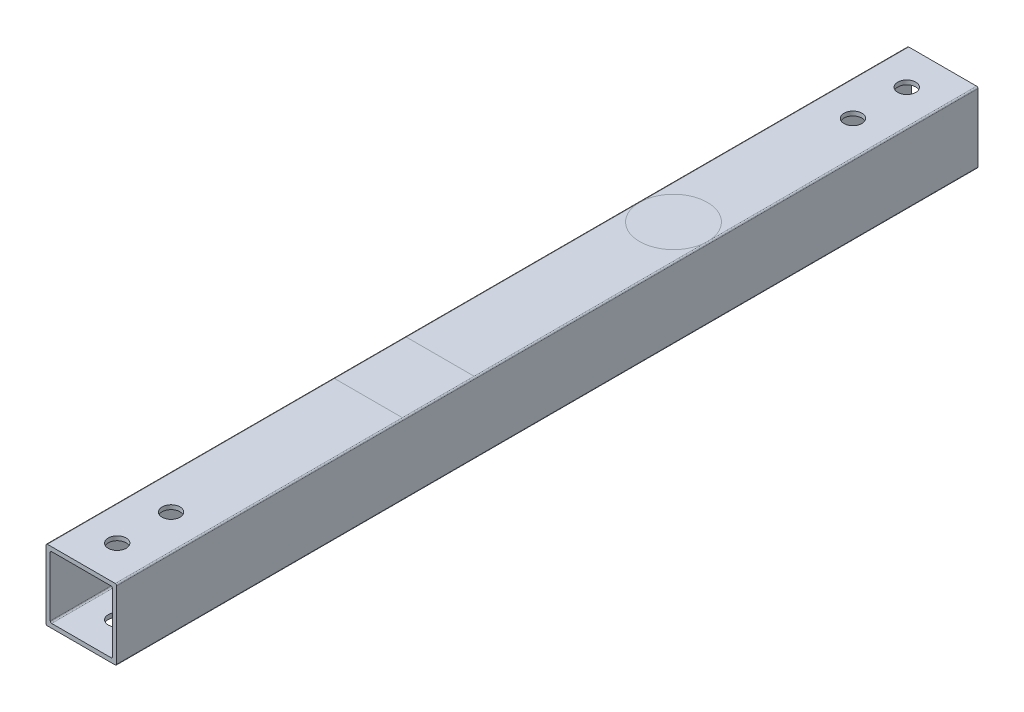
ISO-10303-21;
HEADER;
FILE_DESCRIPTION(('STEP AP214'),'2;1');
FILE_NAME('part.step','',(''),(''),'','','');
FILE_SCHEMA(('AUTOMOTIVE_DESIGN { 1 0 10303 214 1 1 1 1 }'));
ENDSEC;
DATA;
#1=APPLICATION_CONTEXT('core data for automotive mechanical design processes');
#2=APPLICATION_PROTOCOL_DEFINITION('international standard','automotive_design',2000,#1);
#3=PRODUCT_CONTEXT('',#1,'mechanical');
#4=PRODUCT('Part','Part','',(#3));
#5=PRODUCT_RELATED_PRODUCT_CATEGORY('part','',(#4));
#6=PRODUCT_DEFINITION_FORMATION('','',#4);
#7=PRODUCT_DEFINITION_CONTEXT('part definition',#1,'design');
#8=PRODUCT_DEFINITION('design','',#6,#7);
#9=PRODUCT_DEFINITION_SHAPE('','',#8);
#10=(LENGTH_UNIT() NAMED_UNIT(*) SI_UNIT(.MILLI.,.METRE.));
#11=(NAMED_UNIT(*) PLANE_ANGLE_UNIT() SI_UNIT($,.RADIAN.));
#12=(NAMED_UNIT(*) SI_UNIT($,.STERADIAN.) SOLID_ANGLE_UNIT());
#13=UNCERTAINTY_MEASURE_WITH_UNIT(LENGTH_MEASURE(1.E-05),#10,'distance_accuracy_value','');
#14=(GEOMETRIC_REPRESENTATION_CONTEXT(3) GLOBAL_UNCERTAINTY_ASSIGNED_CONTEXT((#13)) GLOBAL_UNIT_ASSIGNED_CONTEXT((#10,
#11,#12)) REPRESENTATION_CONTEXT('',''));
#15=CARTESIAN_POINT('',(0.,0.,0.));
#16=DIRECTION('',(0.,0.,1.));
#17=DIRECTION('',(1.,0.,0.));
#18=AXIS2_PLACEMENT_3D('',#15,#16,#17);
#19=CARTESIAN_POINT('',(-11.9999999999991,12.5,-1695.2));
#20=DIRECTION('',(0.,1.,0.));
#21=DIRECTION('',(-1.,0.,0.));
#22=AXIS2_PLACEMENT_3D('',#19,#20,#21);
#23=PLANE('',#22);
#24=CARTESIAN_POINT('',(0.,12.5,-1968.25));
#25=DIRECTION('',(0.,1.,0.));
#26=DIRECTION('',(-1.,0.,0.));
#27=AXIS2_PLACEMENT_3D('',#24,#25,#26);
#28=CIRCLE('',#27,3.17500000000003);
#29=CARTESIAN_POINT('',(-3.17500000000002,12.5,-1968.25));
#30=VERTEX_POINT('',#29);
#31=EDGE_CURVE('E436',#30,#30,#28,.T.);
#32=ORIENTED_EDGE('',*,*,#31,.F.);
#33=EDGE_LOOP('',(#32));
#34=FACE_BOUND('',#33,.T.);
#35=CARTESIAN_POINT('',(0.,12.5,-1987.3));
#36=DIRECTION('',(0.,1.,0.));
#37=DIRECTION('',(-1.,0.,0.));
#38=AXIS2_PLACEMENT_3D('',#35,#36,#37);
#39=CIRCLE('',#38,3.17500000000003);
#40=CARTESIAN_POINT('',(-3.17500000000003,12.5,-1987.3));
#41=VERTEX_POINT('',#40);
#42=EDGE_CURVE('E559',#41,#41,#39,.T.);
#43=ORIENTED_EDGE('',*,*,#42,.F.);
#44=EDGE_LOOP('',(#43));
#45=FACE_BOUND('',#44,.T.);
#46=DIRECTION('',(0.,0.,-1.));
#47=VECTOR('',#46,1.);
#48=CARTESIAN_POINT('',(-11.9999999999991,12.5,-1695.2));
#49=LINE('',#48,#47);
#50=CARTESIAN_POINT('',(-11.9999999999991,12.5,-1904.75));
#51=VERTEX_POINT('',#50);
#52=CARTESIAN_POINT('',(-11.9999999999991,12.5,-2000.));
#53=VERTEX_POINT('',#52);
#54=EDGE_CURVE('E318',#51,#53,#49,.T.);
#55=ORIENTED_EDGE('',*,*,#54,.F.);
#56=CARTESIAN_POINT('',(0.,12.5,-1904.75));
#57=DIRECTION('',(0.,1.,0.));
#58=DIRECTION('',(-1.,0.,0.));
#59=AXIS2_PLACEMENT_3D('',#56,#57,#58);
#60=CIRCLE('',#59,11.9999999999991);
#61=CARTESIAN_POINT('',(11.9999999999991,12.5,-1904.75));
#62=VERTEX_POINT('',#61);
#63=EDGE_CURVE('E11',#51,#62,#60,.F.);
#64=ORIENTED_EDGE('',*,*,#63,.T.);
#65=DIRECTION('',(0.,0.,-1.));
#66=VECTOR('',#65,1.);
#67=CARTESIAN_POINT('',(11.9999999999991,12.5,-1695.2));
#68=LINE('',#67,#66);
#69=CARTESIAN_POINT('',(11.9999999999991,12.5,-2000.));
#70=VERTEX_POINT('',#69);
#71=EDGE_CURVE('E313',#62,#70,#68,.T.);
#72=ORIENTED_EDGE('',*,*,#71,.T.);
#73=DIRECTION('',(1.,0.,0.));
#74=VECTOR('',#73,1.);
#75=CARTESIAN_POINT('',(-11.9999999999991,12.5,-2000.));
#76=LINE('',#75,#74);
#77=EDGE_CURVE('E286',#53,#70,#76,.T.);
#78=ORIENTED_EDGE('',*,*,#77,.F.);
#79=EDGE_LOOP('',(#55,#64,#72,#78));
#80=FACE_BOUND('',#79,.T.);
#81=ADVANCED_FACE('F45',(#34,#45,#80),#23,.T.);
#82=CARTESIAN_POINT('',(11.9999999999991,12.5,-1822.2));
#83=VERTEX_POINT('',#82);
#84=EDGE_CURVE('E356',#83,#62,#68,.T.);
#85=ORIENTED_EDGE('',*,*,#84,.T.);
#86=EDGE_CURVE('E49',#62,#51,#60,.F.);
#87=ORIENTED_EDGE('',*,*,#86,.T.);
#88=CARTESIAN_POINT('',(-11.9999999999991,12.5,-1822.2));
#89=VERTEX_POINT('',#88);
#90=EDGE_CURVE('E353',#89,#51,#49,.T.);
#91=ORIENTED_EDGE('',*,*,#90,.F.);
#92=DIRECTION('',(1.,0.,0.));
#93=VECTOR('',#92,1.);
#94=CARTESIAN_POINT('',(-11.9999999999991,12.5,-1822.2));
#95=LINE('',#94,#93);
#96=EDGE_CURVE('E302',#89,#83,#95,.T.);
#97=ORIENTED_EDGE('',*,*,#96,.T.);
#98=EDGE_LOOP('',(#85,#87,#91,#97));
#99=FACE_BOUND('',#98,.T.);
#100=ADVANCED_FACE('F351',(#99),#23,.T.);
#101=CARTESIAN_POINT('',(0.,12.5,-1726.95));
#102=DIRECTION('',(0.,1.,0.));
#103=DIRECTION('',(1.,0.,0.));
#104=AXIS2_PLACEMENT_3D('',#101,#102,#103);
#105=CIRCLE('',#104,3.17500000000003);
#106=CARTESIAN_POINT('',(3.17500000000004,12.5,-1726.95));
#107=VERTEX_POINT('',#106);
#108=EDGE_CURVE('E427',#107,#107,#105,.T.);
#109=ORIENTED_EDGE('',*,*,#108,.F.);
#110=EDGE_LOOP('',(#109));
#111=FACE_BOUND('',#110,.T.);
#112=CARTESIAN_POINT('',(0.,12.5,-1707.9));
#113=DIRECTION('',(0.,1.,0.));
#114=DIRECTION('',(1.,0.,0.));
#115=AXIS2_PLACEMENT_3D('',#112,#113,#114);
#116=CIRCLE('',#115,3.17500000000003);
#117=CARTESIAN_POINT('',(3.17500000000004,12.5,-1707.9));
#118=VERTEX_POINT('',#117);
#119=EDGE_CURVE('E430',#118,#118,#116,.T.);
#120=ORIENTED_EDGE('',*,*,#119,.F.);
#121=EDGE_LOOP('',(#120));
#122=FACE_BOUND('',#121,.T.);
#123=CARTESIAN_POINT('',(11.9999999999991,12.5,-1695.2));
#124=VERTEX_POINT('',#123);
#125=CARTESIAN_POINT('',(11.9999999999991,12.5,-1796.8));
#126=VERTEX_POINT('',#125);
#127=EDGE_CURVE('E309',#124,#126,#68,.T.);
#128=ORIENTED_EDGE('',*,*,#127,.T.);
#129=DIRECTION('',(-1.,0.,0.));
#130=VECTOR('',#129,1.);
#131=CARTESIAN_POINT('',(-11.9999999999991,12.5,-1796.8));
#132=LINE('',#131,#130);
#133=CARTESIAN_POINT('',(-11.9999999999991,12.5,-1796.8));
#134=VERTEX_POINT('',#133);
#135=EDGE_CURVE('E339',#126,#134,#132,.T.);
#136=ORIENTED_EDGE('',*,*,#135,.T.);
#137=CARTESIAN_POINT('',(-11.9999999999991,12.5,-1695.2));
#138=VERTEX_POINT('',#137);
#139=EDGE_CURVE('E314',#138,#134,#49,.T.);
#140=ORIENTED_EDGE('',*,*,#139,.F.);
#141=DIRECTION('',(1.,0.,0.));
#142=VECTOR('',#141,1.);
#143=CARTESIAN_POINT('',(-11.9999999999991,12.5,-1695.2));
#144=LINE('',#143,#142);
#145=EDGE_CURVE('E262',#138,#124,#144,.T.);
#146=ORIENTED_EDGE('',*,*,#145,.T.);
#147=EDGE_LOOP('',(#128,#136,#140,#146));
#148=FACE_BOUND('',#147,.T.);
#149=ADVANCED_FACE('F407',(#111,#122,#148),#23,.T.);
#150=ORIENTED_EDGE('',*,*,#63,.F.);
#151=ORIENTED_EDGE('',*,*,#86,.F.);
#152=EDGE_LOOP('',(#150,#151));
#153=FACE_BOUND('',#152,.T.);
#154=ADVANCED_FACE('F412',(#153),#23,.T.);
#155=CARTESIAN_POINT('',(-11.9999999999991,-11.9999999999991,-1695.2));
#156=DIRECTION('',(0.,0.,-1.));
#157=DIRECTION('',(-1.,0.,0.));
#158=AXIS2_PLACEMENT_3D('',#155,#156,#157);
#159=CYLINDRICAL_SURFACE('',#158,0.500000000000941);
#160=CARTESIAN_POINT('',(-11.9999999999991,-11.9999999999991,-2000.));
#161=DIRECTION('',(0.,0.,-1.));
#162=DIRECTION('',(-1.,0.,0.));
#163=AXIS2_PLACEMENT_3D('',#160,#161,#162);
#164=CIRCLE('',#163,0.500000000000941);
#165=CARTESIAN_POINT('',(-11.9999999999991,-12.5,-2000.));
#166=VERTEX_POINT('',#165);
#167=CARTESIAN_POINT('',(-12.5,-11.9999999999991,-2000.));
#168=VERTEX_POINT('',#167);
#169=EDGE_CURVE('E240',#166,#168,#164,.T.);
#170=ORIENTED_EDGE('',*,*,#169,.F.);
#171=DIRECTION('',(0.,0.,-1.));
#172=VECTOR('',#171,1.);
#173=CARTESIAN_POINT('',(-11.9999999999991,-12.5,-1695.2));
#174=LINE('',#173,#172);
#175=CARTESIAN_POINT('',(-11.9999999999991,-12.5,-1695.2));
#176=VERTEX_POINT('',#175);
#177=EDGE_CURVE('E300',#176,#166,#174,.T.);
#178=ORIENTED_EDGE('',*,*,#177,.F.);
#179=CARTESIAN_POINT('',(-11.9999999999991,-11.9999999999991,-1695.2));
#180=DIRECTION('',(0.,0.,-1.));
#181=DIRECTION('',(-1.,0.,0.));
#182=AXIS2_PLACEMENT_3D('',#179,#180,#181);
#183=CIRCLE('',#182,0.500000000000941);
#184=CARTESIAN_POINT('',(-12.5,-11.9999999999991,-1695.2));
#185=VERTEX_POINT('',#184);
#186=EDGE_CURVE('E252',#176,#185,#183,.T.);
#187=ORIENTED_EDGE('',*,*,#186,.T.);
#188=DIRECTION('',(0.,0.,-1.));
#189=VECTOR('',#188,1.);
#190=CARTESIAN_POINT('',(-12.5,-11.9999999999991,-1695.2));
#191=LINE('',#190,#189);
#192=EDGE_CURVE('E277',#185,#168,#191,.T.);
#193=ORIENTED_EDGE('',*,*,#192,.T.);
#194=EDGE_LOOP('',(#170,#178,#187,#193));
#195=FACE_BOUND('',#194,.T.);
#196=ADVANCED_FACE('F47',(#195),#159,.T.);
#197=CARTESIAN_POINT('',(11.9999999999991,-12.5,-1695.2));
#198=DIRECTION('',(0.,-1.,0.));
#199=DIRECTION('',(1.,0.,0.));
#200=AXIS2_PLACEMENT_3D('',#197,#198,#199);
#201=PLANE('',#200);
#202=CARTESIAN_POINT('',(0.,-12.5,-1987.3));
#203=DIRECTION('',(0.,-1.,0.));
#204=DIRECTION('',(1.,0.,0.));
#205=AXIS2_PLACEMENT_3D('',#202,#203,#204);
#206=CIRCLE('',#205,3.17500000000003);
#207=CARTESIAN_POINT('',(3.17500000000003,-12.5,-1987.3));
#208=VERTEX_POINT('',#207);
#209=EDGE_CURVE('E326',#208,#208,#206,.F.);
#210=ORIENTED_EDGE('',*,*,#209,.T.);
#211=EDGE_LOOP('',(#210));
#212=FACE_BOUND('',#211,.T.);
#213=CARTESIAN_POINT('',(0.,-12.5,-1726.95));
#214=DIRECTION('',(0.,-1.,0.));
#215=DIRECTION('',(1.,0.,0.));
#216=AXIS2_PLACEMENT_3D('',#213,#214,#215);
#217=CIRCLE('',#216,3.17500000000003);
#218=CARTESIAN_POINT('',(3.17500000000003,-12.5,-1726.95));
#219=VERTEX_POINT('',#218);
#220=EDGE_CURVE('E550',#219,#219,#217,.F.);
#221=ORIENTED_EDGE('',*,*,#220,.T.);
#222=EDGE_LOOP('',(#221));
#223=FACE_BOUND('',#222,.T.);
#224=CARTESIAN_POINT('',(0.,-12.5,-1707.9));
#225=DIRECTION('',(0.,-1.,0.));
#226=DIRECTION('',(1.,0.,0.));
#227=AXIS2_PLACEMENT_3D('',#224,#225,#226);
#228=CIRCLE('',#227,3.17500000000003);
#229=CARTESIAN_POINT('',(3.17500000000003,-12.5,-1707.9));
#230=VERTEX_POINT('',#229);
#231=EDGE_CURVE('E433',#230,#230,#228,.F.);
#232=ORIENTED_EDGE('',*,*,#231,.T.);
#233=EDGE_LOOP('',(#232));
#234=FACE_BOUND('',#233,.T.);
#235=CARTESIAN_POINT('',(0.,-12.5,-1968.25));
#236=DIRECTION('',(0.,-1.,0.));
#237=DIRECTION('',(1.,0.,0.));
#238=AXIS2_PLACEMENT_3D('',#235,#236,#237);
#239=CIRCLE('',#238,3.17500000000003);
#240=CARTESIAN_POINT('',(3.17500000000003,-12.5,-1968.25));
#241=VERTEX_POINT('',#240);
#242=EDGE_CURVE('E432',#241,#241,#239,.F.);
#243=ORIENTED_EDGE('',*,*,#242,.T.);
#244=EDGE_LOOP('',(#243));
#245=FACE_BOUND('',#244,.T.);
#246=DIRECTION('',(-1.,0.,0.));
#247=VECTOR('',#246,1.);
#248=CARTESIAN_POINT('',(11.9999999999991,-12.5,-2000.));
#249=LINE('',#248,#247);
#250=CARTESIAN_POINT('',(11.9999999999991,-12.5,-2000.));
#251=VERTEX_POINT('',#250);
#252=EDGE_CURVE('E256',#251,#166,#249,.T.);
#253=ORIENTED_EDGE('',*,*,#252,.F.);
#254=DIRECTION('',(0.,0.,-1.));
#255=VECTOR('',#254,1.);
#256=CARTESIAN_POINT('',(11.9999999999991,-12.5,-1695.2));
#257=LINE('',#256,#255);
#258=CARTESIAN_POINT('',(11.9999999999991,-12.5,-1695.2));
#259=VERTEX_POINT('',#258);
#260=EDGE_CURVE('E303',#259,#251,#257,.T.);
#261=ORIENTED_EDGE('',*,*,#260,.F.);
#262=DIRECTION('',(-1.,0.,0.));
#263=VECTOR('',#262,1.);
#264=CARTESIAN_POINT('',(11.9999999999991,-12.5,-1695.2));
#265=LINE('',#264,#263);
#266=EDGE_CURVE('E274',#259,#176,#265,.T.);
#267=ORIENTED_EDGE('',*,*,#266,.T.);
#268=ORIENTED_EDGE('',*,*,#177,.T.);
#269=EDGE_LOOP('',(#253,#261,#267,#268));
#270=FACE_BOUND('',#269,.T.);
#271=ADVANCED_FACE('F386',(#212,#223,#234,#245,#270),#201,.T.);
#272=CARTESIAN_POINT('',(11.9999999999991,-11.9999999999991,-1695.2));
#273=DIRECTION('',(0.,0.,-1.));
#274=DIRECTION('',(-1.,0.,0.));
#275=AXIS2_PLACEMENT_3D('',#272,#273,#274);
#276=CYLINDRICAL_SURFACE('',#275,0.500000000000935);
#277=CARTESIAN_POINT('',(11.9999999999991,-11.9999999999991,-2000.));
#278=DIRECTION('',(0.,0.,-1.));
#279=DIRECTION('',(-1.,0.,0.));
#280=AXIS2_PLACEMENT_3D('',#277,#278,#279);
#281=CIRCLE('',#280,0.500000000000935);
#282=CARTESIAN_POINT('',(12.5,-11.9999999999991,-2000.));
#283=VERTEX_POINT('',#282);
#284=EDGE_CURVE('E295',#283,#251,#281,.T.);
#285=ORIENTED_EDGE('',*,*,#284,.F.);
#286=DIRECTION('',(0.,0.,-1.));
#287=VECTOR('',#286,1.);
#288=CARTESIAN_POINT('',(12.5,-11.9999999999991,-1695.2));
#289=LINE('',#288,#287);
#290=CARTESIAN_POINT('',(12.5,-11.9999999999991,-1695.2));
#291=VERTEX_POINT('',#290);
#292=EDGE_CURVE('E305',#291,#283,#289,.T.);
#293=ORIENTED_EDGE('',*,*,#292,.F.);
#294=CARTESIAN_POINT('',(11.9999999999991,-11.9999999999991,-1695.2));
#295=DIRECTION('',(0.,0.,-1.));
#296=DIRECTION('',(-1.,0.,0.));
#297=AXIS2_PLACEMENT_3D('',#294,#295,#296);
#298=CIRCLE('',#297,0.500000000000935);
#299=EDGE_CURVE('E271',#291,#259,#298,.T.);
#300=ORIENTED_EDGE('',*,*,#299,.T.);
#301=ORIENTED_EDGE('',*,*,#260,.T.);
#302=EDGE_LOOP('',(#285,#293,#300,#301));
#303=FACE_BOUND('',#302,.T.);
#304=ADVANCED_FACE('F389',(#303),#276,.T.);
#305=CARTESIAN_POINT('',(12.5,11.9999999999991,-1695.2));
#306=DIRECTION('',(1.,0.,0.));
#307=DIRECTION('',(0.,1.,0.));
#308=AXIS2_PLACEMENT_3D('',#305,#306,#307);
#309=PLANE('',#308);
#310=DIRECTION('',(0.,-1.,0.));
#311=VECTOR('',#310,1.);
#312=CARTESIAN_POINT('',(12.5,11.9999999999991,-2000.));
#313=LINE('',#312,#311);
#314=CARTESIAN_POINT('',(12.5,11.9999999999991,-2000.));
#315=VERTEX_POINT('',#314);
#316=EDGE_CURVE('E292',#315,#283,#313,.T.);
#317=ORIENTED_EDGE('',*,*,#316,.F.);
#318=DIRECTION('',(0.,0.,-1.));
#319=VECTOR('',#318,1.);
#320=CARTESIAN_POINT('',(12.5,11.9999999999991,-1695.2));
#321=LINE('',#320,#319);
#322=CARTESIAN_POINT('',(12.5,11.9999999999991,-1695.2));
#323=VERTEX_POINT('',#322);
#324=EDGE_CURVE('E307',#323,#315,#321,.T.);
#325=ORIENTED_EDGE('',*,*,#324,.F.);
#326=DIRECTION('',(0.,-1.,0.));
#327=VECTOR('',#326,1.);
#328=CARTESIAN_POINT('',(12.5,11.9999999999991,-1695.2));
#329=LINE('',#328,#327);
#330=EDGE_CURVE('E268',#323,#291,#329,.T.);
#331=ORIENTED_EDGE('',*,*,#330,.T.);
#332=ORIENTED_EDGE('',*,*,#292,.T.);
#333=EDGE_LOOP('',(#317,#325,#331,#332));
#334=FACE_BOUND('',#333,.T.);
#335=ADVANCED_FACE('F392',(#334),#309,.T.);
#336=CARTESIAN_POINT('',(11.9999999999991,11.9999999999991,-1695.2));
#337=DIRECTION('',(0.,0.,-1.));
#338=DIRECTION('',(-1.,0.,0.));
#339=AXIS2_PLACEMENT_3D('',#336,#337,#338);
#340=CYLINDRICAL_SURFACE('',#339,0.500000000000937);
#341=CARTESIAN_POINT('',(11.9999999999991,11.9999999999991,-2000.));
#342=DIRECTION('',(0.,0.,-1.));
#343=DIRECTION('',(-1.,0.,0.));
#344=AXIS2_PLACEMENT_3D('',#341,#342,#343);
#345=CIRCLE('',#344,0.500000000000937);
#346=EDGE_CURVE('E289',#70,#315,#345,.T.);
#347=ORIENTED_EDGE('',*,*,#346,.F.);
#348=ORIENTED_EDGE('',*,*,#71,.F.);
#349=ORIENTED_EDGE('',*,*,#84,.F.);
#350=EDGE_CURVE('E312',#126,#83,#68,.T.);
#351=ORIENTED_EDGE('',*,*,#350,.F.);
#352=ORIENTED_EDGE('',*,*,#127,.F.);
#353=CARTESIAN_POINT('',(11.9999999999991,11.9999999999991,-1695.2));
#354=DIRECTION('',(0.,0.,-1.));
#355=DIRECTION('',(-1.,0.,0.));
#356=AXIS2_PLACEMENT_3D('',#353,#354,#355);
#357=CIRCLE('',#356,0.500000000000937);
#358=EDGE_CURVE('E265',#124,#323,#357,.T.);
#359=ORIENTED_EDGE('',*,*,#358,.T.);
#360=ORIENTED_EDGE('',*,*,#324,.T.);
#361=EDGE_LOOP('',(#347,#348,#349,#351,#352,#359,#360));
#362=FACE_BOUND('',#361,.T.);
#363=ADVANCED_FACE('F368',(#362),#340,.T.);
#364=ORIENTED_EDGE('',*,*,#135,.F.);
#365=ORIENTED_EDGE('',*,*,#350,.T.);
#366=ORIENTED_EDGE('',*,*,#96,.F.);
#367=EDGE_CURVE('E317',#134,#89,#49,.T.);
#368=ORIENTED_EDGE('',*,*,#367,.F.);
#369=EDGE_LOOP('',(#364,#365,#366,#368));
#370=FACE_BOUND('',#369,.T.);
#371=ADVANCED_FACE('F363',(#370),#23,.T.);
#372=CARTESIAN_POINT('',(-11.9999999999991,11.9999999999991,-1695.2));
#373=DIRECTION('',(0.,0.,-1.));
#374=DIRECTION('',(-1.,0.,0.));
#375=AXIS2_PLACEMENT_3D('',#372,#373,#374);
#376=CYLINDRICAL_SURFACE('',#375,0.500000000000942);
#377=CARTESIAN_POINT('',(-11.9999999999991,11.9999999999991,-2000.));
#378=DIRECTION('',(0.,0.,-1.));
#379=DIRECTION('',(-1.,0.,0.));
#380=AXIS2_PLACEMENT_3D('',#377,#378,#379);
#381=CIRCLE('',#380,0.500000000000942);
#382=CARTESIAN_POINT('',(-12.5,11.9999999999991,-2000.));
#383=VERTEX_POINT('',#382);
#384=EDGE_CURVE('E283',#383,#53,#381,.T.);
#385=ORIENTED_EDGE('',*,*,#384,.F.);
#386=DIRECTION('',(0.,0.,-1.));
#387=VECTOR('',#386,1.);
#388=CARTESIAN_POINT('',(-12.5,11.9999999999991,-1695.2));
#389=LINE('',#388,#387);
#390=CARTESIAN_POINT('',(-12.5,11.9999999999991,-1695.2));
#391=VERTEX_POINT('',#390);
#392=EDGE_CURVE('E319',#391,#383,#389,.T.);
#393=ORIENTED_EDGE('',*,*,#392,.F.);
#394=CARTESIAN_POINT('',(-11.9999999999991,11.9999999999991,-1695.2));
#395=DIRECTION('',(0.,0.,-1.));
#396=DIRECTION('',(-1.,0.,0.));
#397=AXIS2_PLACEMENT_3D('',#394,#395,#396);
#398=CIRCLE('',#397,0.500000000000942);
#399=EDGE_CURVE('E259',#391,#138,#398,.T.);
#400=ORIENTED_EDGE('',*,*,#399,.T.);
#401=ORIENTED_EDGE('',*,*,#139,.T.);
#402=ORIENTED_EDGE('',*,*,#367,.T.);
#403=ORIENTED_EDGE('',*,*,#90,.T.);
#404=ORIENTED_EDGE('',*,*,#54,.T.);
#405=EDGE_LOOP('',(#385,#393,#400,#401,#402,#403,#404));
#406=FACE_BOUND('',#405,.T.);
#407=ADVANCED_FACE('F361',(#406),#376,.T.);
#408=CARTESIAN_POINT('',(-12.5,-11.9999999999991,-1695.2));
#409=DIRECTION('',(-1.,0.,0.));
#410=DIRECTION('',(0.,0.,1.));
#411=AXIS2_PLACEMENT_3D('',#408,#409,#410);
#412=PLANE('',#411);
#413=DIRECTION('',(0.,1.,0.));
#414=VECTOR('',#413,1.);
#415=CARTESIAN_POINT('',(-12.5,-11.9999999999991,-2000.));
#416=LINE('',#415,#414);
#417=EDGE_CURVE('E280',#168,#383,#416,.T.);
#418=ORIENTED_EDGE('',*,*,#417,.F.);
#419=ORIENTED_EDGE('',*,*,#192,.F.);
#420=DIRECTION('',(0.,1.,0.));
#421=VECTOR('',#420,1.);
#422=CARTESIAN_POINT('',(-12.5,-11.9999999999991,-1695.2));
#423=LINE('',#422,#421);
#424=EDGE_CURVE('E255',#185,#391,#423,.T.);
#425=ORIENTED_EDGE('',*,*,#424,.T.);
#426=ORIENTED_EDGE('',*,*,#392,.T.);
#427=EDGE_LOOP('',(#418,#419,#425,#426));
#428=FACE_BOUND('',#427,.T.);
#429=ADVANCED_FACE('F379',(#428),#412,.T.);
#430=CARTESIAN_POINT('',(-11.9999999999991,-11.9999999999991,-1695.2));
#431=DIRECTION('',(0.,0.,-1.));
#432=DIRECTION('',(-1.,0.,0.));
#433=AXIS2_PLACEMENT_3D('',#430,#431,#432);
#434=PLANE('',#433);
#435=DIRECTION('',(0.,1.,0.));
#436=VECTOR('',#435,1.);
#437=CARTESIAN_POINT('',(-11.,10.4999999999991,-1695.2));
#438=LINE('',#437,#436);
#439=CARTESIAN_POINT('',(-11.,-10.4999999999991,-1695.2));
#440=VERTEX_POINT('',#439);
#441=CARTESIAN_POINT('',(-11.,10.4999999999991,-1695.2));
#442=VERTEX_POINT('',#441);
#443=EDGE_CURVE('E185',#440,#442,#438,.T.);
#444=ORIENTED_EDGE('',*,*,#443,.T.);
#445=CARTESIAN_POINT('',(-10.4999999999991,10.4999999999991,-1695.2));
#446=DIRECTION('',(0.,0.,-1.));
#447=DIRECTION('',(1.,0.,0.));
#448=AXIS2_PLACEMENT_3D('',#445,#446,#447);
#449=CIRCLE('',#448,0.500000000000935);
#450=CARTESIAN_POINT('',(-10.4999999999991,11.,-1695.2));
#451=VERTEX_POINT('',#450);
#452=EDGE_CURVE('E177',#442,#451,#449,.T.);
#453=ORIENTED_EDGE('',*,*,#452,.T.);
#454=DIRECTION('',(1.,0.,0.));
#455=VECTOR('',#454,1.);
#456=CARTESIAN_POINT('',(10.4999999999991,11.,-1695.2));
#457=LINE('',#456,#455);
#458=CARTESIAN_POINT('',(10.4999999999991,11.,-1695.2));
#459=VERTEX_POINT('',#458);
#460=EDGE_CURVE('E189',#451,#459,#457,.T.);
#461=ORIENTED_EDGE('',*,*,#460,.T.);
#462=CARTESIAN_POINT('',(10.4999999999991,10.4999999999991,-1695.2));
#463=DIRECTION('',(0.,0.,-1.));
#464=DIRECTION('',(1.,0.,0.));
#465=AXIS2_PLACEMENT_3D('',#462,#463,#464);
#466=CIRCLE('',#465,0.500000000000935);
#467=CARTESIAN_POINT('',(11.,10.4999999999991,-1695.2));
#468=VERTEX_POINT('',#467);
#469=EDGE_CURVE('E193',#459,#468,#466,.T.);
#470=ORIENTED_EDGE('',*,*,#469,.T.);
#471=DIRECTION('',(0.,-1.,0.));
#472=VECTOR('',#471,1.);
#473=CARTESIAN_POINT('',(11.,-10.4999999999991,-1695.2));
#474=LINE('',#473,#472);
#475=CARTESIAN_POINT('',(11.,-10.4999999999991,-1695.2));
#476=VERTEX_POINT('',#475);
#477=EDGE_CURVE('E209',#468,#476,#474,.T.);
#478=ORIENTED_EDGE('',*,*,#477,.T.);
#479=CARTESIAN_POINT('',(10.4999999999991,-10.4999999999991,-1695.2));
#480=DIRECTION('',(0.,0.,-1.));
#481=DIRECTION('',(1.,0.,0.));
#482=AXIS2_PLACEMENT_3D('',#479,#480,#481);
#483=CIRCLE('',#482,0.500000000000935);
#484=CARTESIAN_POINT('',(10.4999999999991,-11.,-1695.2));
#485=VERTEX_POINT('',#484);
#486=EDGE_CURVE('E212',#476,#485,#483,.T.);
#487=ORIENTED_EDGE('',*,*,#486,.T.);
#488=DIRECTION('',(-1.,0.,0.));
#489=VECTOR('',#488,1.);
#490=CARTESIAN_POINT('',(-10.4999999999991,-11.,-1695.2));
#491=LINE('',#490,#489);
#492=CARTESIAN_POINT('',(-10.4999999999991,-11.,-1695.2));
#493=VERTEX_POINT('',#492);
#494=EDGE_CURVE('E215',#485,#493,#491,.T.);
#495=ORIENTED_EDGE('',*,*,#494,.T.);
#496=CARTESIAN_POINT('',(-10.4999999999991,-10.4999999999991,-1695.2));
#497=DIRECTION('',(0.,0.,-1.));
#498=DIRECTION('',(1.,0.,0.));
#499=AXIS2_PLACEMENT_3D('',#496,#497,#498);
#500=CIRCLE('',#499,0.500000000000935);
#501=EDGE_CURVE('E218',#493,#440,#500,.T.);
#502=ORIENTED_EDGE('',*,*,#501,.T.);
#503=EDGE_LOOP('',(#444,#453,#461,#470,#478,#487,#495,#502));
#504=FACE_BOUND('',#503,.T.);
#505=ORIENTED_EDGE('',*,*,#186,.F.);
#506=ORIENTED_EDGE('',*,*,#266,.F.);
#507=ORIENTED_EDGE('',*,*,#299,.F.);
#508=ORIENTED_EDGE('',*,*,#330,.F.);
#509=ORIENTED_EDGE('',*,*,#358,.F.);
#510=ORIENTED_EDGE('',*,*,#145,.F.);
#511=ORIENTED_EDGE('',*,*,#399,.F.);
#512=ORIENTED_EDGE('',*,*,#424,.F.);
#513=EDGE_LOOP('',(#505,#506,#507,#508,#509,#510,#511,#512));
#514=FACE_BOUND('',#513,.T.);
#515=ADVANCED_FACE('F195',(#504,#514),#434,.F.);
#516=CARTESIAN_POINT('',(-11.9999999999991,-11.9999999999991,-2000.));
#517=DIRECTION('',(0.,0.,-1.));
#518=DIRECTION('',(-1.,0.,0.));
#519=AXIS2_PLACEMENT_3D('',#516,#517,#518);
#520=PLANE('',#519);
#521=CARTESIAN_POINT('',(-10.4999999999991,10.4999999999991,-2000.));
#522=DIRECTION('',(0.,0.,-1.));
#523=DIRECTION('',(1.,0.,0.));
#524=AXIS2_PLACEMENT_3D('',#521,#522,#523);
#525=CIRCLE('',#524,0.500000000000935);
#526=CARTESIAN_POINT('',(-11.,10.4999999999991,-2000.));
#527=VERTEX_POINT('',#526);
#528=CARTESIAN_POINT('',(-10.4999999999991,11.,-2000.));
#529=VERTEX_POINT('',#528);
#530=EDGE_CURVE('E180',#527,#529,#525,.T.);
#531=ORIENTED_EDGE('',*,*,#530,.F.);
#532=DIRECTION('',(0.,1.,0.));
#533=VECTOR('',#532,1.);
#534=CARTESIAN_POINT('',(-11.,10.4999999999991,-2000.));
#535=LINE('',#534,#533);
#536=CARTESIAN_POINT('',(-11.,-10.4999999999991,-2000.));
#537=VERTEX_POINT('',#536);
#538=EDGE_CURVE('E199',#537,#527,#535,.T.);
#539=ORIENTED_EDGE('',*,*,#538,.F.);
#540=CARTESIAN_POINT('',(-10.4999999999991,-10.4999999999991,-2000.));
#541=DIRECTION('',(0.,0.,-1.));
#542=DIRECTION('',(1.,0.,0.));
#543=AXIS2_PLACEMENT_3D('',#540,#541,#542);
#544=CIRCLE('',#543,0.500000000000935);
#545=CARTESIAN_POINT('',(-10.4999999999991,-11.,-2000.));
#546=VERTEX_POINT('',#545);
#547=EDGE_CURVE('E202',#546,#537,#544,.T.);
#548=ORIENTED_EDGE('',*,*,#547,.F.);
#549=DIRECTION('',(-1.,0.,0.));
#550=VECTOR('',#549,1.);
#551=CARTESIAN_POINT('',(-10.4999999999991,-11.,-2000.));
#552=LINE('',#551,#550);
#553=CARTESIAN_POINT('',(10.4999999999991,-11.,-2000.));
#554=VERTEX_POINT('',#553);
#555=EDGE_CURVE('E233',#554,#546,#552,.T.);
#556=ORIENTED_EDGE('',*,*,#555,.F.);
#557=CARTESIAN_POINT('',(10.4999999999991,-10.4999999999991,-2000.));
#558=DIRECTION('',(0.,0.,-1.));
#559=DIRECTION('',(1.,0.,0.));
#560=AXIS2_PLACEMENT_3D('',#557,#558,#559);
#561=CIRCLE('',#560,0.500000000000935);
#562=CARTESIAN_POINT('',(11.,-10.4999999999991,-2000.));
#563=VERTEX_POINT('',#562);
#564=EDGE_CURVE('E230',#563,#554,#561,.T.);
#565=ORIENTED_EDGE('',*,*,#564,.F.);
#566=DIRECTION('',(0.,-1.,0.));
#567=VECTOR('',#566,1.);
#568=CARTESIAN_POINT('',(11.,-10.4999999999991,-2000.));
#569=LINE('',#568,#567);
#570=CARTESIAN_POINT('',(11.,10.4999999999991,-2000.));
#571=VERTEX_POINT('',#570);
#572=EDGE_CURVE('E227',#571,#563,#569,.T.);
#573=ORIENTED_EDGE('',*,*,#572,.F.);
#574=CARTESIAN_POINT('',(10.4999999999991,10.4999999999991,-2000.));
#575=DIRECTION('',(0.,0.,-1.));
#576=DIRECTION('',(1.,0.,0.));
#577=AXIS2_PLACEMENT_3D('',#574,#575,#576);
#578=CIRCLE('',#577,0.500000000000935);
#579=CARTESIAN_POINT('',(10.4999999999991,11.,-2000.));
#580=VERTEX_POINT('',#579);
#581=EDGE_CURVE('E224',#580,#571,#578,.T.);
#582=ORIENTED_EDGE('',*,*,#581,.F.);
#583=DIRECTION('',(1.,0.,0.));
#584=VECTOR('',#583,1.);
#585=CARTESIAN_POINT('',(10.4999999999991,11.,-2000.));
#586=LINE('',#585,#584);
#587=EDGE_CURVE('E222',#529,#580,#586,.T.);
#588=ORIENTED_EDGE('',*,*,#587,.F.);
#589=EDGE_LOOP('',(#531,#539,#548,#556,#565,#573,#582,#588));
#590=FACE_BOUND('',#589,.T.);
#591=ORIENTED_EDGE('',*,*,#169,.T.);
#592=ORIENTED_EDGE('',*,*,#417,.T.);
#593=ORIENTED_EDGE('',*,*,#384,.T.);
#594=ORIENTED_EDGE('',*,*,#77,.T.);
#595=ORIENTED_EDGE('',*,*,#346,.T.);
#596=ORIENTED_EDGE('',*,*,#316,.T.);
#597=ORIENTED_EDGE('',*,*,#284,.T.);
#598=ORIENTED_EDGE('',*,*,#252,.T.);
#599=EDGE_LOOP('',(#591,#592,#593,#594,#595,#596,#597,#598));
#600=FACE_BOUND('',#599,.T.);
#601=ADVANCED_FACE('F371',(#590,#600),#520,.T.);
#602=CARTESIAN_POINT('',(-10.4999999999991,10.4999999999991,-1695.2));
#603=DIRECTION('',(0.,0.,-1.));
#604=DIRECTION('',(-1.,0.,0.));
#605=AXIS2_PLACEMENT_3D('',#602,#603,#604);
#606=CYLINDRICAL_SURFACE('',#605,0.500000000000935);
#607=ORIENTED_EDGE('',*,*,#530,.T.);
#608=DIRECTION('',(0.,0.,-1.));
#609=VECTOR('',#608,1.);
#610=CARTESIAN_POINT('',(-10.4999999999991,11.,-1695.2));
#611=LINE('',#610,#609);
#612=EDGE_CURVE('E173',#451,#529,#611,.T.);
#613=ORIENTED_EDGE('',*,*,#612,.F.);
#614=ORIENTED_EDGE('',*,*,#452,.F.);
#615=DIRECTION('',(0.,0.,-1.));
#616=VECTOR('',#615,1.);
#617=CARTESIAN_POINT('',(-11.,10.4999999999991,-1695.2));
#618=LINE('',#617,#616);
#619=EDGE_CURVE('E238',#442,#527,#618,.T.);
#620=ORIENTED_EDGE('',*,*,#619,.T.);
#621=EDGE_LOOP('',(#607,#613,#614,#620));
#622=FACE_BOUND('',#621,.T.);
#623=ADVANCED_FACE('F175',(#622),#606,.F.);
#624=CARTESIAN_POINT('',(-11.,10.4999999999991,-1695.2));
#625=DIRECTION('',(-1.,0.,0.));
#626=DIRECTION('',(0.,-1.,0.));
#627=AXIS2_PLACEMENT_3D('',#624,#625,#626);
#628=PLANE('',#627);
#629=ORIENTED_EDGE('',*,*,#538,.T.);
#630=ORIENTED_EDGE('',*,*,#619,.F.);
#631=ORIENTED_EDGE('',*,*,#443,.F.);
#632=DIRECTION('',(0.,0.,-1.));
#633=VECTOR('',#632,1.);
#634=CARTESIAN_POINT('',(-11.,-10.4999999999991,-1695.2));
#635=LINE('',#634,#633);
#636=EDGE_CURVE('E241',#440,#537,#635,.T.);
#637=ORIENTED_EDGE('',*,*,#636,.T.);
#638=EDGE_LOOP('',(#629,#630,#631,#637));
#639=FACE_BOUND('',#638,.T.);
#640=ADVANCED_FACE('F536',(#639),#628,.F.);
#641=CARTESIAN_POINT('',(-10.4999999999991,-10.4999999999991,-1695.2));
#642=DIRECTION('',(0.,0.,-1.));
#643=DIRECTION('',(-1.,0.,0.));
#644=AXIS2_PLACEMENT_3D('',#641,#642,#643);
#645=CYLINDRICAL_SURFACE('',#644,0.500000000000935);
#646=ORIENTED_EDGE('',*,*,#547,.T.);
#647=ORIENTED_EDGE('',*,*,#636,.F.);
#648=ORIENTED_EDGE('',*,*,#501,.F.);
#649=DIRECTION('',(0.,0.,-1.));
#650=VECTOR('',#649,1.);
#651=CARTESIAN_POINT('',(-10.4999999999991,-11.,-1695.2));
#652=LINE('',#651,#650);
#653=EDGE_CURVE('E243',#493,#546,#652,.T.);
#654=ORIENTED_EDGE('',*,*,#653,.T.);
#655=EDGE_LOOP('',(#646,#647,#648,#654));
#656=FACE_BOUND('',#655,.T.);
#657=ADVANCED_FACE('F507',(#656),#645,.F.);
#658=CARTESIAN_POINT('',(-10.4999999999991,-11.,-1695.2));
#659=DIRECTION('',(0.,-1.,0.));
#660=DIRECTION('',(0.,0.,-1.));
#661=AXIS2_PLACEMENT_3D('',#658,#659,#660);
#662=PLANE('',#661);
#663=CARTESIAN_POINT('',(0.,-11.,-1987.3));
#664=DIRECTION('',(0.,-1.,0.));
#665=DIRECTION('',(0.,0.,-1.));
#666=AXIS2_PLACEMENT_3D('',#663,#664,#665);
#667=CIRCLE('',#666,3.17500000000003);
#668=CARTESIAN_POINT('',(0.,-11.,-1990.475));
#669=VERTEX_POINT('',#668);
#670=EDGE_CURVE('E205',#669,#669,#667,.T.);
#671=ORIENTED_EDGE('',*,*,#670,.T.);
#672=EDGE_LOOP('',(#671));
#673=FACE_BOUND('',#672,.T.);
#674=CARTESIAN_POINT('',(0.,-11.,-1726.95));
#675=DIRECTION('',(0.,-1.,0.));
#676=DIRECTION('',(0.,0.,-1.));
#677=AXIS2_PLACEMENT_3D('',#674,#675,#676);
#678=CIRCLE('',#677,3.17500000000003);
#679=CARTESIAN_POINT('',(0.,-11.,-1730.125));
#680=VERTEX_POINT('',#679);
#681=EDGE_CURVE('E334',#680,#680,#678,.T.);
#682=ORIENTED_EDGE('',*,*,#681,.T.);
#683=EDGE_LOOP('',(#682));
#684=FACE_BOUND('',#683,.T.);
#685=CARTESIAN_POINT('',(0.,-11.,-1707.9));
#686=DIRECTION('',(0.,-1.,0.));
#687=DIRECTION('',(0.,0.,-1.));
#688=AXIS2_PLACEMENT_3D('',#685,#686,#687);
#689=CIRCLE('',#688,3.17500000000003);
#690=CARTESIAN_POINT('',(0.,-11.,-1711.075));
#691=VERTEX_POINT('',#690);
#692=EDGE_CURVE('E330',#691,#691,#689,.T.);
#693=ORIENTED_EDGE('',*,*,#692,.T.);
#694=EDGE_LOOP('',(#693));
#695=FACE_BOUND('',#694,.T.);
#696=CARTESIAN_POINT('',(0.,-11.,-1968.25));
#697=DIRECTION('',(0.,-1.,0.));
#698=DIRECTION('',(0.,0.,-1.));
#699=AXIS2_PLACEMENT_3D('',#696,#697,#698);
#700=CIRCLE('',#699,3.17500000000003);
#701=CARTESIAN_POINT('',(0.,-11.,-1971.425));
#702=VERTEX_POINT('',#701);
#703=EDGE_CURVE('E325',#702,#702,#700,.T.);
#704=ORIENTED_EDGE('',*,*,#703,.T.);
#705=EDGE_LOOP('',(#704));
#706=FACE_BOUND('',#705,.T.);
#707=ORIENTED_EDGE('',*,*,#555,.T.);
#708=ORIENTED_EDGE('',*,*,#653,.F.);
#709=ORIENTED_EDGE('',*,*,#494,.F.);
#710=DIRECTION('',(0.,0.,-1.));
#711=VECTOR('',#710,1.);
#712=CARTESIAN_POINT('',(10.4999999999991,-11.,-1695.2));
#713=LINE('',#712,#711);
#714=EDGE_CURVE('E245',#485,#554,#713,.T.);
#715=ORIENTED_EDGE('',*,*,#714,.T.);
#716=EDGE_LOOP('',(#707,#708,#709,#715));
#717=FACE_BOUND('',#716,.T.);
#718=ADVANCED_FACE('F448',(#673,#684,#695,#706,#717),#662,.F.);
#719=CARTESIAN_POINT('',(10.4999999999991,-10.4999999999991,-1695.2));
#720=DIRECTION('',(0.,0.,-1.));
#721=DIRECTION('',(-1.,0.,0.));
#722=AXIS2_PLACEMENT_3D('',#719,#720,#721);
#723=CYLINDRICAL_SURFACE('',#722,0.500000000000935);
#724=ORIENTED_EDGE('',*,*,#564,.T.);
#725=ORIENTED_EDGE('',*,*,#714,.F.);
#726=ORIENTED_EDGE('',*,*,#486,.F.);
#727=DIRECTION('',(0.,0.,-1.));
#728=VECTOR('',#727,1.);
#729=CARTESIAN_POINT('',(11.,-10.4999999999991,-1695.2));
#730=LINE('',#729,#728);
#731=EDGE_CURVE('E247',#476,#563,#730,.T.);
#732=ORIENTED_EDGE('',*,*,#731,.T.);
#733=EDGE_LOOP('',(#724,#725,#726,#732));
#734=FACE_BOUND('',#733,.T.);
#735=ADVANCED_FACE('F506',(#734),#723,.F.);
#736=CARTESIAN_POINT('',(11.,-10.4999999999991,-1695.2));
#737=DIRECTION('',(1.,0.,0.));
#738=DIRECTION('',(0.,0.,-1.));
#739=AXIS2_PLACEMENT_3D('',#736,#737,#738);
#740=PLANE('',#739);
#741=ORIENTED_EDGE('',*,*,#572,.T.);
#742=ORIENTED_EDGE('',*,*,#731,.F.);
#743=ORIENTED_EDGE('',*,*,#477,.F.);
#744=DIRECTION('',(0.,0.,-1.));
#745=VECTOR('',#744,1.);
#746=CARTESIAN_POINT('',(11.,10.4999999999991,-1695.2));
#747=LINE('',#746,#745);
#748=EDGE_CURVE('E249',#468,#571,#747,.T.);
#749=ORIENTED_EDGE('',*,*,#748,.T.);
#750=EDGE_LOOP('',(#741,#742,#743,#749));
#751=FACE_BOUND('',#750,.T.);
#752=ADVANCED_FACE('F524',(#751),#740,.F.);
#753=CARTESIAN_POINT('',(10.4999999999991,10.4999999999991,-1695.2));
#754=DIRECTION('',(0.,0.,-1.));
#755=DIRECTION('',(-1.,0.,0.));
#756=AXIS2_PLACEMENT_3D('',#753,#754,#755);
#757=CYLINDRICAL_SURFACE('',#756,0.500000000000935);
#758=ORIENTED_EDGE('',*,*,#581,.T.);
#759=ORIENTED_EDGE('',*,*,#748,.F.);
#760=ORIENTED_EDGE('',*,*,#469,.F.);
#761=DIRECTION('',(0.,0.,-1.));
#762=VECTOR('',#761,1.);
#763=CARTESIAN_POINT('',(10.4999999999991,11.,-1695.2));
#764=LINE('',#763,#762);
#765=EDGE_CURVE('E184',#459,#580,#764,.T.);
#766=ORIENTED_EDGE('',*,*,#765,.T.);
#767=EDGE_LOOP('',(#758,#759,#760,#766));
#768=FACE_BOUND('',#767,.T.);
#769=ADVANCED_FACE('F484',(#768),#757,.F.);
#770=CARTESIAN_POINT('',(10.4999999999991,11.,-1695.2));
#771=DIRECTION('',(0.,1.,0.));
#772=DIRECTION('',(-1.,0.,0.));
#773=AXIS2_PLACEMENT_3D('',#770,#771,#772);
#774=PLANE('',#773);
#775=CARTESIAN_POINT('',(0.,11.,-1987.3));
#776=DIRECTION('',(0.,1.,0.));
#777=DIRECTION('',(-1.,0.,0.));
#778=AXIS2_PLACEMENT_3D('',#775,#776,#777);
#779=CIRCLE('',#778,3.17500000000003);
#780=CARTESIAN_POINT('',(-3.17500000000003,11.,-1987.3));
#781=VERTEX_POINT('',#780);
#782=EDGE_CURVE('E335',#781,#781,#779,.T.);
#783=ORIENTED_EDGE('',*,*,#782,.T.);
#784=EDGE_LOOP('',(#783));
#785=FACE_BOUND('',#784,.T.);
#786=CARTESIAN_POINT('',(0.,11.,-1726.95));
#787=DIRECTION('',(0.,1.,0.));
#788=DIRECTION('',(-1.,0.,0.));
#789=AXIS2_PLACEMENT_3D('',#786,#787,#788);
#790=CIRCLE('',#789,3.17500000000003);
#791=CARTESIAN_POINT('',(-3.17500000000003,11.,-1726.95));
#792=VERTEX_POINT('',#791);
#793=EDGE_CURVE('E331',#792,#792,#790,.T.);
#794=ORIENTED_EDGE('',*,*,#793,.T.);
#795=EDGE_LOOP('',(#794));
#796=FACE_BOUND('',#795,.T.);
#797=CARTESIAN_POINT('',(0.,11.,-1707.9));
#798=DIRECTION('',(0.,1.,0.));
#799=DIRECTION('',(-1.,0.,0.));
#800=AXIS2_PLACEMENT_3D('',#797,#798,#799);
#801=CIRCLE('',#800,3.17500000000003);
#802=CARTESIAN_POINT('',(-3.17500000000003,11.,-1707.9));
#803=VERTEX_POINT('',#802);
#804=EDGE_CURVE('E327',#803,#803,#801,.T.);
#805=ORIENTED_EDGE('',*,*,#804,.T.);
#806=EDGE_LOOP('',(#805));
#807=FACE_BOUND('',#806,.T.);
#808=CARTESIAN_POINT('',(0.,11.,-1968.25));
#809=DIRECTION('',(0.,1.,0.));
#810=DIRECTION('',(-1.,0.,0.));
#811=AXIS2_PLACEMENT_3D('',#808,#809,#810);
#812=CIRCLE('',#811,3.17500000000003);
#813=CARTESIAN_POINT('',(-3.17500000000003,11.,-1968.25));
#814=VERTEX_POINT('',#813);
#815=EDGE_CURVE('E322',#814,#814,#812,.T.);
#816=ORIENTED_EDGE('',*,*,#815,.T.);
#817=EDGE_LOOP('',(#816));
#818=FACE_BOUND('',#817,.T.);
#819=ORIENTED_EDGE('',*,*,#587,.T.);
#820=ORIENTED_EDGE('',*,*,#765,.F.);
#821=ORIENTED_EDGE('',*,*,#460,.F.);
#822=ORIENTED_EDGE('',*,*,#612,.T.);
#823=EDGE_LOOP('',(#819,#820,#821,#822));
#824=FACE_BOUND('',#823,.T.);
#825=ADVANCED_FACE('F190',(#785,#796,#807,#818,#824),#774,.F.);
#826=CARTESIAN_POINT('',(0.,-21.4802561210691,-1968.25));
#827=DIRECTION('',(0.,1.,0.));
#828=DIRECTION('',(-1.,0.,0.));
#829=AXIS2_PLACEMENT_3D('',#826,#827,#828);
#830=CYLINDRICAL_SURFACE('',#829,3.17500000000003);
#831=ORIENTED_EDGE('',*,*,#31,.T.);
#832=EDGE_LOOP('',(#831));
#833=FACE_BOUND('',#832,.T.);
#834=ORIENTED_EDGE('',*,*,#815,.F.);
#835=EDGE_LOOP('',(#834));
#836=FACE_BOUND('',#835,.T.);
#837=ADVANCED_FACE('F478',(#833,#836),#830,.F.);
#838=CARTESIAN_POINT('',(0.,-21.4802561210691,-1707.9));
#839=DIRECTION('',(0.,1.,0.));
#840=DIRECTION('',(-1.,0.,0.));
#841=AXIS2_PLACEMENT_3D('',#838,#839,#840);
#842=CYLINDRICAL_SURFACE('',#841,3.17500000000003);
#843=ORIENTED_EDGE('',*,*,#119,.T.);
#844=EDGE_LOOP('',(#843));
#845=FACE_BOUND('',#844,.T.);
#846=ORIENTED_EDGE('',*,*,#804,.F.);
#847=EDGE_LOOP('',(#846));
#848=FACE_BOUND('',#847,.T.);
#849=ADVANCED_FACE('F468',(#845,#848),#842,.F.);
#850=CARTESIAN_POINT('',(0.,-21.4802561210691,-1726.95));
#851=DIRECTION('',(0.,1.,0.));
#852=DIRECTION('',(-1.,0.,0.));
#853=AXIS2_PLACEMENT_3D('',#850,#851,#852);
#854=CYLINDRICAL_SURFACE('',#853,3.17500000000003);
#855=ORIENTED_EDGE('',*,*,#108,.T.);
#856=EDGE_LOOP('',(#855));
#857=FACE_BOUND('',#856,.T.);
#858=ORIENTED_EDGE('',*,*,#793,.F.);
#859=EDGE_LOOP('',(#858));
#860=FACE_BOUND('',#859,.T.);
#861=ADVANCED_FACE('F457',(#857,#860),#854,.F.);
#862=CARTESIAN_POINT('',(0.,-21.4802561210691,-1987.3));
#863=DIRECTION('',(0.,1.,0.));
#864=DIRECTION('',(-1.,0.,0.));
#865=AXIS2_PLACEMENT_3D('',#862,#863,#864);
#866=CYLINDRICAL_SURFACE('',#865,3.17500000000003);
#867=ORIENTED_EDGE('',*,*,#42,.T.);
#868=EDGE_LOOP('',(#867));
#869=FACE_BOUND('',#868,.T.);
#870=ORIENTED_EDGE('',*,*,#782,.F.);
#871=EDGE_LOOP('',(#870));
#872=FACE_BOUND('',#871,.T.);
#873=ADVANCED_FACE('F464',(#869,#872),#866,.F.);
#874=ORIENTED_EDGE('',*,*,#242,.F.);
#875=EDGE_LOOP('',(#874));
#876=FACE_BOUND('',#875,.T.);
#877=ORIENTED_EDGE('',*,*,#703,.F.);
#878=EDGE_LOOP('',(#877));
#879=FACE_BOUND('',#878,.T.);
#880=ADVANCED_FACE('F465',(#876,#879),#830,.F.);
#881=ORIENTED_EDGE('',*,*,#231,.F.);
#882=EDGE_LOOP('',(#881));
#883=FACE_BOUND('',#882,.T.);
#884=ORIENTED_EDGE('',*,*,#692,.F.);
#885=EDGE_LOOP('',(#884));
#886=FACE_BOUND('',#885,.T.);
#887=ADVANCED_FACE('F454',(#883,#886),#842,.F.);
#888=ORIENTED_EDGE('',*,*,#220,.F.);
#889=EDGE_LOOP('',(#888));
#890=FACE_BOUND('',#889,.T.);
#891=ORIENTED_EDGE('',*,*,#681,.F.);
#892=EDGE_LOOP('',(#891));
#893=FACE_BOUND('',#892,.T.);
#894=ADVANCED_FACE('F451',(#890,#893),#854,.F.);
#895=ORIENTED_EDGE('',*,*,#209,.F.);
#896=EDGE_LOOP('',(#895));
#897=FACE_BOUND('',#896,.T.);
#898=ORIENTED_EDGE('',*,*,#670,.F.);
#899=EDGE_LOOP('',(#898));
#900=FACE_BOUND('',#899,.T.);
#901=ADVANCED_FACE('F453',(#897,#900),#866,.F.);
#902=CLOSED_SHELL('',(#81,#100,#149,#154,#196,#271,#304,#335,#363,#371,#407,#429,#515,#601,#623,
#640,#657,#718,#735,#752,#769,#825,#837,#849,#861,#873,#880,#887,#894,#901));
#903=MANIFOLD_SOLID_BREP('B2',#902);
#904=ADVANCED_BREP_SHAPE_REPRESENTATION('',(#18,#903),#14);
#905=SHAPE_DEFINITION_REPRESENTATION(#9,#904);
ENDSEC;
END-ISO-10303-21;
